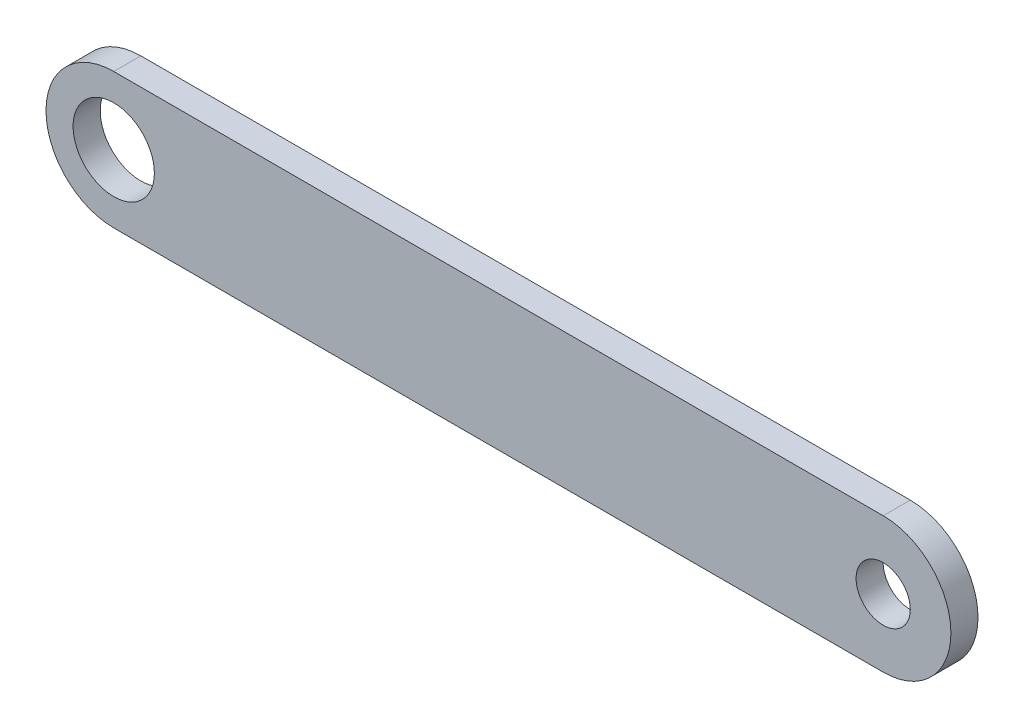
ISO-10303-21;
HEADER;
FILE_DESCRIPTION(('STEP AP214'),'2;1');
FILE_NAME('part.step','',(''),(''),'','','');
FILE_SCHEMA(('AUTOMOTIVE_DESIGN { 1 0 10303 214 1 1 1 1 }'));
ENDSEC;
DATA;
#1=APPLICATION_CONTEXT('core data for automotive mechanical design processes');
#2=APPLICATION_PROTOCOL_DEFINITION('international standard','automotive_design',2000,#1);
#3=PRODUCT_CONTEXT('',#1,'mechanical');
#4=PRODUCT('Part','Part','',(#3));
#5=PRODUCT_RELATED_PRODUCT_CATEGORY('part','',(#4));
#6=PRODUCT_DEFINITION_FORMATION('','',#4);
#7=PRODUCT_DEFINITION_CONTEXT('part definition',#1,'design');
#8=PRODUCT_DEFINITION('design','',#6,#7);
#9=PRODUCT_DEFINITION_SHAPE('','',#8);
#10=(LENGTH_UNIT() NAMED_UNIT(*) SI_UNIT(.MILLI.,.METRE.));
#11=(NAMED_UNIT(*) PLANE_ANGLE_UNIT() SI_UNIT($,.RADIAN.));
#12=(NAMED_UNIT(*) SI_UNIT($,.STERADIAN.) SOLID_ANGLE_UNIT());
#13=UNCERTAINTY_MEASURE_WITH_UNIT(LENGTH_MEASURE(1.E-05),#10,'distance_accuracy_value','');
#14=(GEOMETRIC_REPRESENTATION_CONTEXT(3) GLOBAL_UNCERTAINTY_ASSIGNED_CONTEXT((#13)) GLOBAL_UNIT_ASSIGNED_CONTEXT((#10,
#11,#12)) REPRESENTATION_CONTEXT('',''));
#15=CARTESIAN_POINT('',(0.,0.,0.));
#16=DIRECTION('',(0.,0.,1.));
#17=DIRECTION('',(1.,0.,0.));
#18=AXIS2_PLACEMENT_3D('',#15,#16,#17);
#19=CARTESIAN_POINT('',(-71.,0.,5.));
#20=DIRECTION('',(0.,0.,-1.));
#21=DIRECTION('',(-1.,0.,0.));
#22=AXIS2_PLACEMENT_3D('',#19,#20,#21);
#23=CYLINDRICAL_SURFACE('',#22,12.5);
#24=CARTESIAN_POINT('',(-71.,0.,0.));
#25=DIRECTION('',(0.,0.,1.));
#26=DIRECTION('',(1.,0.,0.));
#27=AXIS2_PLACEMENT_3D('',#24,#25,#26);
#28=CIRCLE('',#27,12.5);
#29=CARTESIAN_POINT('',(-71.,12.5,0.));
#30=VERTEX_POINT('',#29);
#31=CARTESIAN_POINT('',(-71.,-12.5,0.));
#32=VERTEX_POINT('',#31);
#33=EDGE_CURVE('E95',#30,#32,#28,.T.);
#34=ORIENTED_EDGE('',*,*,#33,.T.);
#35=DIRECTION('',(0.,0.,-1.));
#36=VECTOR('',#35,1.);
#37=CARTESIAN_POINT('',(-71.,-12.5,5.));
#38=LINE('',#37,#36);
#39=CARTESIAN_POINT('',(-71.,-12.5,5.));
#40=VERTEX_POINT('',#39);
#41=EDGE_CURVE('E11',#40,#32,#38,.T.);
#42=ORIENTED_EDGE('',*,*,#41,.F.);
#43=CARTESIAN_POINT('',(-71.,0.,5.));
#44=DIRECTION('',(0.,0.,1.));
#45=DIRECTION('',(1.,0.,0.));
#46=AXIS2_PLACEMENT_3D('',#43,#44,#45);
#47=CIRCLE('',#46,12.5);
#48=CARTESIAN_POINT('',(-71.,12.5,5.));
#49=VERTEX_POINT('',#48);
#50=EDGE_CURVE('E83',#49,#40,#47,.T.);
#51=ORIENTED_EDGE('',*,*,#50,.F.);
#52=DIRECTION('',(0.,0.,-1.));
#53=VECTOR('',#52,1.);
#54=CARTESIAN_POINT('',(-71.,12.5,5.));
#55=LINE('',#54,#53);
#56=EDGE_CURVE('E91',#49,#30,#55,.T.);
#57=ORIENTED_EDGE('',*,*,#56,.T.);
#58=EDGE_LOOP('',(#34,#42,#51,#57));
#59=FACE_BOUND('',#58,.T.);
#60=ADVANCED_FACE('F32',(#59),#23,.T.);
#61=CARTESIAN_POINT('',(-71.,-12.5,5.));
#62=DIRECTION('',(0.,1.,0.));
#63=DIRECTION('',(-1.,0.,0.));
#64=AXIS2_PLACEMENT_3D('',#61,#62,#63);
#65=PLANE('',#64);
#66=DIRECTION('',(1.,0.,0.));
#67=VECTOR('',#66,1.);
#68=CARTESIAN_POINT('',(-71.,-12.5,0.));
#69=LINE('',#68,#67);
#70=CARTESIAN_POINT('',(71.,-12.5,0.));
#71=VERTEX_POINT('',#70);
#72=EDGE_CURVE('E87',#32,#71,#69,.T.);
#73=ORIENTED_EDGE('',*,*,#72,.T.);
#74=DIRECTION('',(0.,0.,-1.));
#75=VECTOR('',#74,1.);
#76=CARTESIAN_POINT('',(71.,-12.5,5.));
#77=LINE('',#76,#75);
#78=CARTESIAN_POINT('',(71.,-12.5,5.));
#79=VERTEX_POINT('',#78);
#80=EDGE_CURVE('E40',#79,#71,#77,.T.);
#81=ORIENTED_EDGE('',*,*,#80,.F.);
#82=DIRECTION('',(1.,0.,0.));
#83=VECTOR('',#82,1.);
#84=CARTESIAN_POINT('',(-71.,-12.5,5.));
#85=LINE('',#84,#83);
#86=EDGE_CURVE('E78',#40,#79,#85,.T.);
#87=ORIENTED_EDGE('',*,*,#86,.F.);
#88=ORIENTED_EDGE('',*,*,#41,.T.);
#89=EDGE_LOOP('',(#73,#81,#87,#88));
#90=FACE_BOUND('',#89,.T.);
#91=ADVANCED_FACE('F86',(#90),#65,.F.);
#92=CARTESIAN_POINT('',(71.,0.,5.));
#93=DIRECTION('',(0.,0.,-1.));
#94=DIRECTION('',(-1.,0.,0.));
#95=AXIS2_PLACEMENT_3D('',#92,#93,#94);
#96=CYLINDRICAL_SURFACE('',#95,12.5);
#97=CARTESIAN_POINT('',(71.,0.,0.));
#98=DIRECTION('',(0.,0.,1.));
#99=DIRECTION('',(1.,0.,0.));
#100=AXIS2_PLACEMENT_3D('',#97,#98,#99);
#101=CIRCLE('',#100,12.5);
#102=CARTESIAN_POINT('',(71.,12.5,0.));
#103=VERTEX_POINT('',#102);
#104=EDGE_CURVE('E65',#71,#103,#101,.T.);
#105=ORIENTED_EDGE('',*,*,#104,.T.);
#106=DIRECTION('',(0.,0.,-1.));
#107=VECTOR('',#106,1.);
#108=CARTESIAN_POINT('',(71.,12.5,5.));
#109=LINE('',#108,#107);
#110=CARTESIAN_POINT('',(71.,12.5,5.));
#111=VERTEX_POINT('',#110);
#112=EDGE_CURVE('E88',#111,#103,#109,.T.);
#113=ORIENTED_EDGE('',*,*,#112,.F.);
#114=CARTESIAN_POINT('',(71.,0.,5.));
#115=DIRECTION('',(0.,0.,1.));
#116=DIRECTION('',(1.,0.,0.));
#117=AXIS2_PLACEMENT_3D('',#114,#115,#116);
#118=CIRCLE('',#117,12.5);
#119=EDGE_CURVE('E81',#79,#111,#118,.T.);
#120=ORIENTED_EDGE('',*,*,#119,.F.);
#121=ORIENTED_EDGE('',*,*,#80,.T.);
#122=EDGE_LOOP('',(#105,#113,#120,#121));
#123=FACE_BOUND('',#122,.T.);
#124=ADVANCED_FACE('F89',(#123),#96,.T.);
#125=CARTESIAN_POINT('',(-71.,12.5,5.));
#126=DIRECTION('',(0.,-1.,0.));
#127=DIRECTION('',(1.,0.,0.));
#128=AXIS2_PLACEMENT_3D('',#125,#126,#127);
#129=PLANE('',#128);
#130=DIRECTION('',(-1.,0.,0.));
#131=VECTOR('',#130,1.);
#132=CARTESIAN_POINT('',(-71.,12.5,0.));
#133=LINE('',#132,#131);
#134=EDGE_CURVE('E71',#103,#30,#133,.T.);
#135=ORIENTED_EDGE('',*,*,#134,.T.);
#136=ORIENTED_EDGE('',*,*,#56,.F.);
#137=DIRECTION('',(-1.,0.,0.));
#138=VECTOR('',#137,1.);
#139=CARTESIAN_POINT('',(-71.,12.5,5.));
#140=LINE('',#139,#138);
#141=EDGE_CURVE('E48',#111,#49,#140,.T.);
#142=ORIENTED_EDGE('',*,*,#141,.F.);
#143=ORIENTED_EDGE('',*,*,#112,.T.);
#144=EDGE_LOOP('',(#135,#136,#142,#143));
#145=FACE_BOUND('',#144,.T.);
#146=ADVANCED_FACE('F103',(#145),#129,.F.);
#147=CARTESIAN_POINT('',(-71.,0.,5.));
#148=DIRECTION('',(0.,0.,1.));
#149=DIRECTION('',(1.,0.,0.));
#150=AXIS2_PLACEMENT_3D('',#147,#148,#149);
#151=PLANE('',#150);
#152=CARTESIAN_POINT('',(71.,0.,5.));
#153=DIRECTION('',(0.,0.,1.));
#154=DIRECTION('',(1.,0.,0.));
#155=AXIS2_PLACEMENT_3D('',#152,#153,#154);
#156=CIRCLE('',#155,5.);
#157=CARTESIAN_POINT('',(76.,0.,5.));
#158=VERTEX_POINT('',#157);
#159=EDGE_CURVE('E117',#158,#158,#156,.T.);
#160=ORIENTED_EDGE('',*,*,#159,.F.);
#161=EDGE_LOOP('',(#160));
#162=FACE_BOUND('',#161,.T.);
#163=CARTESIAN_POINT('',(-71.,0.,5.));
#164=DIRECTION('',(0.,0.,1.));
#165=DIRECTION('',(1.,0.,0.));
#166=AXIS2_PLACEMENT_3D('',#163,#164,#165);
#167=CIRCLE('',#166,7.49999999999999);
#168=CARTESIAN_POINT('',(-63.5,0.,5.));
#169=VERTEX_POINT('',#168);
#170=EDGE_CURVE('E111',#169,#169,#167,.T.);
#171=ORIENTED_EDGE('',*,*,#170,.F.);
#172=EDGE_LOOP('',(#171));
#173=FACE_BOUND('',#172,.T.);
#174=ORIENTED_EDGE('',*,*,#50,.T.);
#175=ORIENTED_EDGE('',*,*,#86,.T.);
#176=ORIENTED_EDGE('',*,*,#119,.T.);
#177=ORIENTED_EDGE('',*,*,#141,.T.);
#178=EDGE_LOOP('',(#174,#175,#176,#177));
#179=FACE_BOUND('',#178,.T.);
#180=ADVANCED_FACE('F79',(#162,#173,#179),#151,.T.);
#181=CARTESIAN_POINT('',(-71.,0.,0.));
#182=DIRECTION('',(0.,0.,1.));
#183=DIRECTION('',(1.,0.,0.));
#184=AXIS2_PLACEMENT_3D('',#181,#182,#183);
#185=PLANE('',#184);
#186=CARTESIAN_POINT('',(71.,0.,0.));
#187=DIRECTION('',(0.,0.,1.));
#188=DIRECTION('',(1.,0.,0.));
#189=AXIS2_PLACEMENT_3D('',#186,#187,#188);
#190=CIRCLE('',#189,5.);
#191=CARTESIAN_POINT('',(76.,0.,0.));
#192=VERTEX_POINT('',#191);
#193=EDGE_CURVE('E114',#192,#192,#190,.T.);
#194=ORIENTED_EDGE('',*,*,#193,.T.);
#195=EDGE_LOOP('',(#194));
#196=FACE_BOUND('',#195,.T.);
#197=CARTESIAN_POINT('',(-71.,0.,0.));
#198=DIRECTION('',(0.,0.,1.));
#199=DIRECTION('',(1.,0.,0.));
#200=AXIS2_PLACEMENT_3D('',#197,#198,#199);
#201=CIRCLE('',#200,7.49999999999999);
#202=CARTESIAN_POINT('',(-63.5,0.,0.));
#203=VERTEX_POINT('',#202);
#204=EDGE_CURVE('E98',#203,#203,#201,.T.);
#205=ORIENTED_EDGE('',*,*,#204,.T.);
#206=EDGE_LOOP('',(#205));
#207=FACE_BOUND('',#206,.T.);
#208=ORIENTED_EDGE('',*,*,#33,.F.);
#209=ORIENTED_EDGE('',*,*,#134,.F.);
#210=ORIENTED_EDGE('',*,*,#104,.F.);
#211=ORIENTED_EDGE('',*,*,#72,.F.);
#212=EDGE_LOOP('',(#208,#209,#210,#211));
#213=FACE_BOUND('',#212,.T.);
#214=ADVANCED_FACE('F106',(#196,#207,#213),#185,.F.);
#215=CARTESIAN_POINT('',(-71.,0.,5.));
#216=DIRECTION('',(0.,0.,1.));
#217=DIRECTION('',(1.,0.,0.));
#218=AXIS2_PLACEMENT_3D('',#215,#216,#217);
#219=CYLINDRICAL_SURFACE('',#218,7.49999999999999);
#220=ORIENTED_EDGE('',*,*,#204,.F.);
#221=EDGE_LOOP('',(#220));
#222=FACE_BOUND('',#221,.T.);
#223=ORIENTED_EDGE('',*,*,#170,.T.);
#224=EDGE_LOOP('',(#223));
#225=FACE_BOUND('',#224,.T.);
#226=ADVANCED_FACE('F128',(#222,#225),#219,.F.);
#227=CARTESIAN_POINT('',(71.,0.,5.));
#228=DIRECTION('',(0.,0.,1.));
#229=DIRECTION('',(1.,0.,0.));
#230=AXIS2_PLACEMENT_3D('',#227,#228,#229);
#231=CYLINDRICAL_SURFACE('',#230,5.);
#232=ORIENTED_EDGE('',*,*,#193,.F.);
#233=EDGE_LOOP('',(#232));
#234=FACE_BOUND('',#233,.T.);
#235=ORIENTED_EDGE('',*,*,#159,.T.);
#236=EDGE_LOOP('',(#235));
#237=FACE_BOUND('',#236,.T.);
#238=ADVANCED_FACE('F121',(#234,#237),#231,.F.);
#239=CLOSED_SHELL('',(#60,#91,#124,#146,#180,#214,#226,#238));
#240=MANIFOLD_SOLID_BREP('B2',#239);
#241=ADVANCED_BREP_SHAPE_REPRESENTATION('',(#18,#240),#14);
#242=SHAPE_DEFINITION_REPRESENTATION(#9,#241);
ENDSEC;
END-ISO-10303-21;
